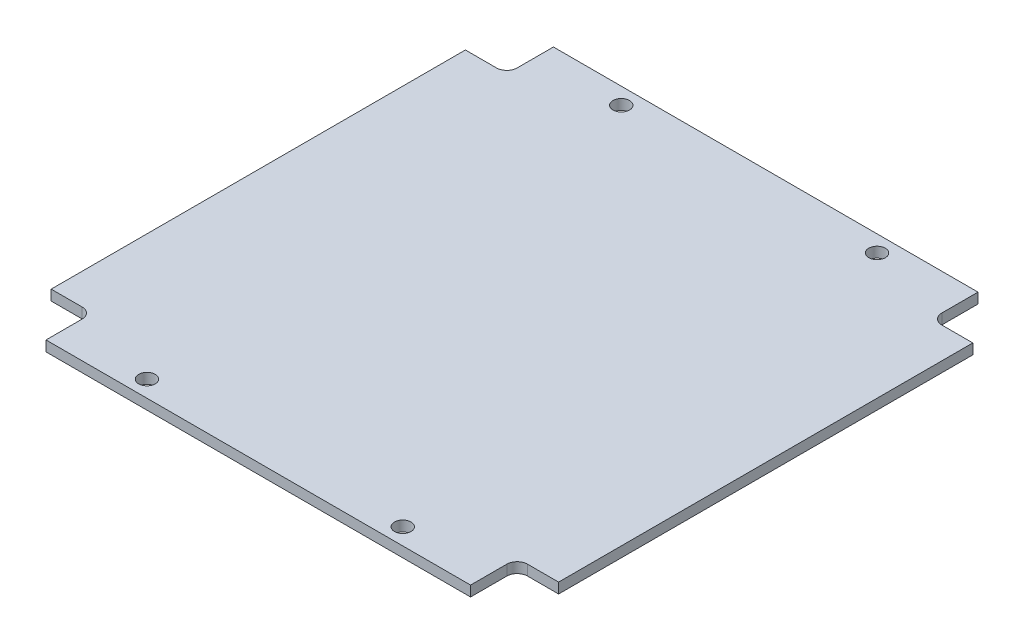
from build123d import *

# Parameters (mm, degrees)
BOSS_EXTRUDE1_DEPTH        = 2
F_3_2_3_2_DIAMETER_HOLE1_D = 3.2


with BuildPart() as part:
    # Sketch1 → Boss-Extrude1 (new body)
    with BuildSketch(Plane(origin=(0, 0, 0), x_dir=(1, 0, 0), z_dir=(0, 1, 0))):
        with BuildLine():
            Line((-49, 40), (-49, -40))
            Line((-49, -40), (-43, -40))
            ThreePointArc((-43, -40), (-41.585786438, -40.585786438), (-41, -42))
            Line((-41, -42), (-41, -49))
            Line((-41, -49), (41, -49))
            Line((41, -49), (41, -42))
            ThreePointArc((41, -42), (41.585786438, -40.585786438), (43, -40))
            Line((43, -40), (49, -40))
            Line((49, -40), (49, 40))
            Line((49, 40), (43, 40))
            ThreePointArc((43, 40), (41.585786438, 40.585786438), (41, 42))
            Line((41, 42), (41, 49))
            Line((41, 49), (-41, 49))
            Line((-41, 49), (-41, 42))
            ThreePointArc((-41, 42), (-41.585786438, 40.585786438), (-43, 40))
            Line((-43, 40), (-49, 40))
        make_face()
    extrude(amount=BOSS_EXTRUDE1_DEPTH)

    # 3.2 _3.2_ Diameter Hole1 (through all)
    with Locations(Plane(origin=(0, 2, 0), x_dir=(1, 0, 0), z_dir=(0, 1, 0))):
        with Locations((24.7, 45.8), (-24.7, 45.8), (-24.7, -45.8), (24.7, -45.8)):
            Hole(F_3_2_3_2_DIAMETER_HOLE1_D / 2)


solid = part.part
